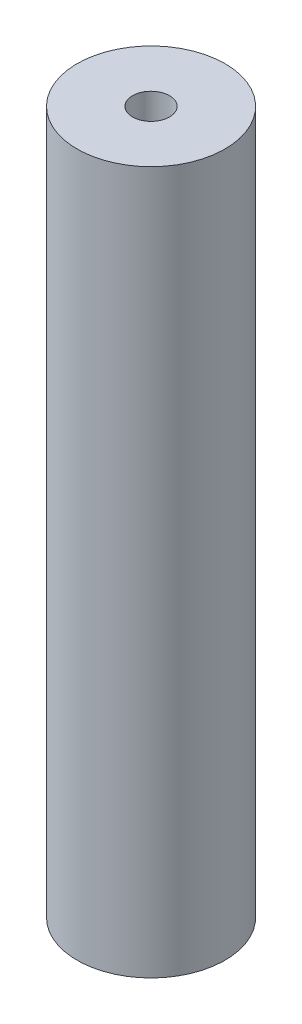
ISO-10303-21;
HEADER;
FILE_DESCRIPTION(('STEP AP214'),'2;1');
FILE_NAME('part.step','',(''),(''),'','','');
FILE_SCHEMA(('AUTOMOTIVE_DESIGN { 1 0 10303 214 1 1 1 1 }'));
ENDSEC;
DATA;
#1=APPLICATION_CONTEXT('core data for automotive mechanical design processes');
#2=APPLICATION_PROTOCOL_DEFINITION('international standard','automotive_design',2000,#1);
#3=PRODUCT_CONTEXT('',#1,'mechanical');
#4=PRODUCT('Part','Part','',(#3));
#5=PRODUCT_RELATED_PRODUCT_CATEGORY('part','',(#4));
#6=PRODUCT_DEFINITION_FORMATION('','',#4);
#7=PRODUCT_DEFINITION_CONTEXT('part definition',#1,'design');
#8=PRODUCT_DEFINITION('design','',#6,#7);
#9=PRODUCT_DEFINITION_SHAPE('','',#8);
#10=(LENGTH_UNIT() NAMED_UNIT(*) SI_UNIT(.MILLI.,.METRE.));
#11=(NAMED_UNIT(*) PLANE_ANGLE_UNIT() SI_UNIT($,.RADIAN.));
#12=(NAMED_UNIT(*) SI_UNIT($,.STERADIAN.) SOLID_ANGLE_UNIT());
#13=UNCERTAINTY_MEASURE_WITH_UNIT(LENGTH_MEASURE(1.E-05),#10,'distance_accuracy_value','');
#14=(GEOMETRIC_REPRESENTATION_CONTEXT(3) GLOBAL_UNCERTAINTY_ASSIGNED_CONTEXT((#13)) GLOBAL_UNIT_ASSIGNED_CONTEXT((#10,
#11,#12)) REPRESENTATION_CONTEXT('',''));
#15=CARTESIAN_POINT('',(0.,0.,0.));
#16=DIRECTION('',(0.,0.,1.));
#17=DIRECTION('',(1.,0.,0.));
#18=AXIS2_PLACEMENT_3D('',#15,#16,#17);
#19=CARTESIAN_POINT('',(0.,77.9999999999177,0.));
#20=DIRECTION('',(0.,1.,0.));
#21=DIRECTION('',(0.,0.,1.));
#22=AXIS2_PLACEMENT_3D('',#19,#20,#21);
#23=CONICAL_SURFACE('',#22,2.49999999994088,1.02974425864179);
#24=CARTESIAN_POINT('',(0.,76.497848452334,0.));
#25=VERTEX_POINT('',#24);
#26=VERTEX_LOOP('',#25);
#27=FACE_BOUND('',#26,.T.);
#28=CARTESIAN_POINT('',(0.,78.,0.));
#29=DIRECTION('',(0.,1.,0.));
#30=DIRECTION('',(0.,0.,1.));
#31=AXIS2_PLACEMENT_3D('',#28,#29,#30);
#32=CIRCLE('',#31,2.49999999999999);
#33=CARTESIAN_POINT('',(0.,78.,2.49999999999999));
#34=VERTEX_POINT('',#33);
#35=EDGE_CURVE('E37',#34,#34,#32,.T.);
#36=ORIENTED_EDGE('',*,*,#35,.T.);
#37=EDGE_LOOP('',(#36));
#38=FACE_BOUND('',#37,.T.);
#39=ADVANCED_FACE('F17',(#27,#38),#23,.F.);
#40=CARTESIAN_POINT('',(0.,17.0000000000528,0.));
#41=DIRECTION('',(0.,-1.,0.));
#42=DIRECTION('',(0.,0.,-1.));
#43=AXIS2_PLACEMENT_3D('',#40,#41,#42);
#44=CONICAL_SURFACE('',#43,2.49999999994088,1.02974425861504);
#45=CARTESIAN_POINT('',(0.,18.5021515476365,2.8421709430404E-11));
#46=VERTEX_POINT('',#45);
#47=VERTEX_LOOP('',#46);
#48=FACE_BOUND('',#47,.T.);
#49=CARTESIAN_POINT('',(0.,17.,0.));
#50=DIRECTION('',(0.,-1.,0.));
#51=DIRECTION('',(0.,0.,-1.));
#52=AXIS2_PLACEMENT_3D('',#49,#50,#51);
#53=CIRCLE('',#52,2.49999999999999);
#54=CARTESIAN_POINT('',(0.,17.,-2.49999999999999));
#55=VERTEX_POINT('',#54);
#56=EDGE_CURVE('E39',#55,#55,#53,.T.);
#57=ORIENTED_EDGE('',*,*,#56,.T.);
#58=EDGE_LOOP('',(#57));
#59=FACE_BOUND('',#58,.T.);
#60=ADVANCED_FACE('F34',(#48,#59),#44,.F.);
#61=CARTESIAN_POINT('',(0.,95.,0.));
#62=DIRECTION('',(0.,1.,0.));
#63=DIRECTION('',(0.,0.,1.));
#64=AXIS2_PLACEMENT_3D('',#61,#62,#63);
#65=CYLINDRICAL_SURFACE('',#64,2.49999999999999);
#66=CARTESIAN_POINT('',(0.,95.,0.));
#67=DIRECTION('',(0.,1.,0.));
#68=DIRECTION('',(0.,0.,1.));
#69=AXIS2_PLACEMENT_3D('',#66,#67,#68);
#70=CIRCLE('',#69,2.49999999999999);
#71=CARTESIAN_POINT('',(0.,95.,2.49999999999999));
#72=VERTEX_POINT('',#71);
#73=EDGE_CURVE('E20',#72,#72,#70,.F.);
#74=ORIENTED_EDGE('',*,*,#73,.F.);
#75=EDGE_LOOP('',(#74));
#76=FACE_BOUND('',#75,.T.);
#77=ORIENTED_EDGE('',*,*,#35,.F.);
#78=EDGE_LOOP('',(#77));
#79=FACE_BOUND('',#78,.T.);
#80=ADVANCED_FACE('F54',(#76,#79),#65,.F.);
#81=CARTESIAN_POINT('',(0.,0.,0.));
#82=DIRECTION('',(0.,-1.,0.));
#83=DIRECTION('',(0.,0.,-1.));
#84=AXIS2_PLACEMENT_3D('',#81,#82,#83);
#85=CYLINDRICAL_SURFACE('',#84,2.49999999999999);
#86=ORIENTED_EDGE('',*,*,#56,.F.);
#87=EDGE_LOOP('',(#86));
#88=FACE_BOUND('',#87,.T.);
#89=CARTESIAN_POINT('',(0.,0.,0.));
#90=DIRECTION('',(0.,-1.,0.));
#91=DIRECTION('',(0.,0.,-1.));
#92=AXIS2_PLACEMENT_3D('',#89,#90,#91);
#93=CIRCLE('',#92,2.49999999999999);
#94=CARTESIAN_POINT('',(0.,0.,-2.49999999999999));
#95=VERTEX_POINT('',#94);
#96=EDGE_CURVE('E45',#95,#95,#93,.T.);
#97=ORIENTED_EDGE('',*,*,#96,.T.);
#98=EDGE_LOOP('',(#97));
#99=FACE_BOUND('',#98,.T.);
#100=ADVANCED_FACE('F56',(#88,#99),#85,.F.);
#101=CARTESIAN_POINT('',(0.,95.,0.));
#102=DIRECTION('',(0.,1.,0.));
#103=DIRECTION('',(0.,0.,1.));
#104=AXIS2_PLACEMENT_3D('',#101,#102,#103);
#105=PLANE('',#104);
#106=CARTESIAN_POINT('',(0.,95.,0.));
#107=DIRECTION('',(0.,-1.,0.));
#108=DIRECTION('',(0.,0.,-1.));
#109=AXIS2_PLACEMENT_3D('',#106,#107,#108);
#110=CIRCLE('',#109,10.);
#111=CARTESIAN_POINT('',(0.,95.,-10.));
#112=VERTEX_POINT('',#111);
#113=EDGE_CURVE('E26',#112,#112,#110,.T.);
#114=ORIENTED_EDGE('',*,*,#113,.F.);
#115=EDGE_LOOP('',(#114));
#116=FACE_BOUND('',#115,.T.);
#117=ORIENTED_EDGE('',*,*,#73,.T.);
#118=EDGE_LOOP('',(#117));
#119=FACE_BOUND('',#118,.T.);
#120=ADVANCED_FACE('F52',(#116,#119),#105,.T.);
#121=CARTESIAN_POINT('',(0.,0.,0.));
#122=DIRECTION('',(0.,1.,0.));
#123=DIRECTION('',(0.,0.,1.));
#124=AXIS2_PLACEMENT_3D('',#121,#122,#123);
#125=PLANE('',#124);
#126=CARTESIAN_POINT('',(0.,0.,0.));
#127=DIRECTION('',(0.,-1.,0.));
#128=DIRECTION('',(0.,0.,-1.));
#129=AXIS2_PLACEMENT_3D('',#126,#127,#128);
#130=CIRCLE('',#129,10.);
#131=CARTESIAN_POINT('',(0.,0.,-10.));
#132=VERTEX_POINT('',#131);
#133=EDGE_CURVE('E11',#132,#132,#130,.F.);
#134=ORIENTED_EDGE('',*,*,#133,.F.);
#135=EDGE_LOOP('',(#134));
#136=FACE_BOUND('',#135,.T.);
#137=ORIENTED_EDGE('',*,*,#96,.F.);
#138=EDGE_LOOP('',(#137));
#139=FACE_BOUND('',#138,.T.);
#140=ADVANCED_FACE('F67',(#136,#139),#125,.F.);
#141=CARTESIAN_POINT('',(0.,95.,0.));
#142=DIRECTION('',(0.,-1.,0.));
#143=DIRECTION('',(0.,0.,-1.));
#144=AXIS2_PLACEMENT_3D('',#141,#142,#143);
#145=CYLINDRICAL_SURFACE('',#144,10.);
#146=ORIENTED_EDGE('',*,*,#133,.T.);
#147=EDGE_LOOP('',(#146));
#148=FACE_BOUND('',#147,.T.);
#149=ORIENTED_EDGE('',*,*,#113,.T.);
#150=EDGE_LOOP('',(#149));
#151=FACE_BOUND('',#150,.T.);
#152=ADVANCED_FACE('F65',(#148,#151),#145,.T.);
#153=CLOSED_SHELL('',(#39,#60,#80,#100,#120,#140,#152));
#154=MANIFOLD_SOLID_BREP('B1',#153);
#155=ADVANCED_BREP_SHAPE_REPRESENTATION('',(#18,#154),#14);
#156=SHAPE_DEFINITION_REPRESENTATION(#9,#155);
ENDSEC;
END-ISO-10303-21;
